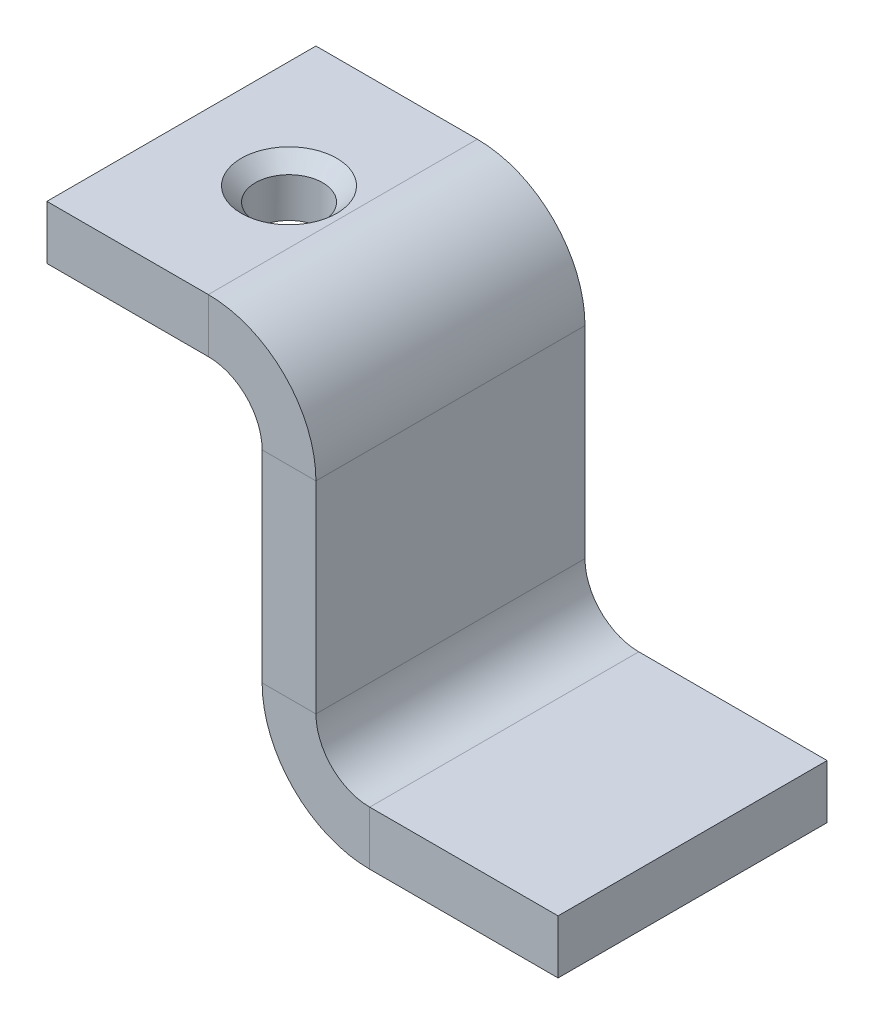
ISO-10303-21;
HEADER;
FILE_DESCRIPTION(('STEP AP214'),'2;1');
FILE_NAME('part.step','',(''),(''),'','','');
FILE_SCHEMA(('AUTOMOTIVE_DESIGN { 1 0 10303 214 1 1 1 1 }'));
ENDSEC;
DATA;
#1=APPLICATION_CONTEXT('core data for automotive mechanical design processes');
#2=APPLICATION_PROTOCOL_DEFINITION('international standard','automotive_design',2000,#1);
#3=PRODUCT_CONTEXT('',#1,'mechanical');
#4=PRODUCT('Part','Part','',(#3));
#5=PRODUCT_RELATED_PRODUCT_CATEGORY('part','',(#4));
#6=PRODUCT_DEFINITION_FORMATION('','',#4);
#7=PRODUCT_DEFINITION_CONTEXT('part definition',#1,'design');
#8=PRODUCT_DEFINITION('design','',#6,#7);
#9=PRODUCT_DEFINITION_SHAPE('','',#8);
#10=(LENGTH_UNIT() NAMED_UNIT(*) SI_UNIT(.MILLI.,.METRE.));
#11=(NAMED_UNIT(*) PLANE_ANGLE_UNIT() SI_UNIT($,.RADIAN.));
#12=(NAMED_UNIT(*) SI_UNIT($,.STERADIAN.) SOLID_ANGLE_UNIT());
#13=UNCERTAINTY_MEASURE_WITH_UNIT(LENGTH_MEASURE(1.E-05),#10,'distance_accuracy_value','');
#14=(GEOMETRIC_REPRESENTATION_CONTEXT(3) GLOBAL_UNCERTAINTY_ASSIGNED_CONTEXT((#13)) GLOBAL_UNIT_ASSIGNED_CONTEXT((#10,
#11,#12)) REPRESENTATION_CONTEXT('',''));
#15=CARTESIAN_POINT('',(0.,0.,0.));
#16=DIRECTION('',(0.,0.,1.));
#17=DIRECTION('',(1.,0.,0.));
#18=AXIS2_PLACEMENT_3D('',#15,#16,#17);
#19=CARTESIAN_POINT('',(-13.2359777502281,9.5,10.));
#20=DIRECTION('',(0.,0.,1.));
#21=DIRECTION('',(1.,0.,0.));
#22=AXIS2_PLACEMENT_3D('',#19,#20,#21);
#23=PLANE('',#22);
#24=DIRECTION('',(-1.,0.,0.));
#25=VECTOR('',#24,1.);
#26=CARTESIAN_POINT('',(-13.2359777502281,9.5,10.));
#27=LINE('',#26,#25);
#28=CARTESIAN_POINT('',(-13.2359777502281,9.5,10.));
#29=VERTEX_POINT('',#28);
#30=CARTESIAN_POINT('',(-15.2359777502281,9.5,10.));
#31=VERTEX_POINT('',#30);
#32=EDGE_CURVE('E13',#29,#31,#27,.T.);
#33=ORIENTED_EDGE('',*,*,#32,.F.);
#34=CARTESIAN_POINT('',(-17.2359777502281,9.5,10.));
#35=DIRECTION('',(0.,0.,1.));
#36=DIRECTION('',(1.,0.,0.));
#37=AXIS2_PLACEMENT_3D('',#34,#35,#36);
#38=CIRCLE('',#37,4.);
#39=CARTESIAN_POINT('',(-17.2359777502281,13.5,10.));
#40=VERTEX_POINT('',#39);
#41=EDGE_CURVE('E262',#40,#29,#38,.F.);
#42=ORIENTED_EDGE('',*,*,#41,.F.);
#43=DIRECTION('',(0.,1.,0.));
#44=VECTOR('',#43,1.);
#45=CARTESIAN_POINT('',(-17.2359777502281,11.5,10.));
#46=LINE('',#45,#44);
#47=CARTESIAN_POINT('',(-17.2359777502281,11.5,10.));
#48=VERTEX_POINT('',#47);
#49=EDGE_CURVE('E59',#48,#40,#46,.T.);
#50=ORIENTED_EDGE('',*,*,#49,.F.);
#51=CARTESIAN_POINT('',(-17.2359777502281,9.5,10.));
#52=DIRECTION('',(0.,0.,1.));
#53=DIRECTION('',(1.,0.,0.));
#54=AXIS2_PLACEMENT_3D('',#51,#52,#53);
#55=CIRCLE('',#54,2.);
#56=EDGE_CURVE('E160',#48,#31,#55,.F.);
#57=ORIENTED_EDGE('',*,*,#56,.T.);
#58=EDGE_LOOP('',(#33,#42,#50,#57));
#59=FACE_BOUND('',#58,.T.);
#60=ADVANCED_FACE('F50',(#59),#23,.T.);
#61=CARTESIAN_POINT('',(-17.2359777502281,11.5,10.));
#62=DIRECTION('',(0.,0.,1.));
#63=DIRECTION('',(1.,0.,0.));
#64=AXIS2_PLACEMENT_3D('',#61,#62,#63);
#65=PLANE('',#64);
#66=DIRECTION('',(0.,-1.,0.));
#67=VECTOR('',#66,1.);
#68=CARTESIAN_POINT('',(-13.2359777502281,13.5,10.));
#69=LINE('',#68,#67);
#70=CARTESIAN_POINT('',(-13.2359777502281,2.,10.));
#71=VERTEX_POINT('',#70);
#72=EDGE_CURVE('E154',#29,#71,#69,.T.);
#73=ORIENTED_EDGE('',*,*,#72,.F.);
#74=ORIENTED_EDGE('',*,*,#32,.T.);
#75=DIRECTION('',(0.,-1.,0.));
#76=VECTOR('',#75,1.);
#77=CARTESIAN_POINT('',(-15.2359777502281,13.5,10.));
#78=LINE('',#77,#76);
#79=CARTESIAN_POINT('',(-15.2359777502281,2.,10.));
#80=VERTEX_POINT('',#79);
#81=EDGE_CURVE('E151',#31,#80,#78,.T.);
#82=ORIENTED_EDGE('',*,*,#81,.T.);
#83=DIRECTION('',(1.,0.,0.));
#84=VECTOR('',#83,1.);
#85=CARTESIAN_POINT('',(-15.2359777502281,2.,10.));
#86=LINE('',#85,#84);
#87=EDGE_CURVE('E242',#80,#71,#86,.T.);
#88=ORIENTED_EDGE('',*,*,#87,.T.);
#89=EDGE_LOOP('',(#73,#74,#82,#88));
#90=FACE_BOUND('',#89,.T.);
#91=ADVANCED_FACE('F149',(#90),#65,.T.);
#92=CARTESIAN_POINT('',(-17.2359777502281,13.5,0.));
#93=DIRECTION('',(0.,0.,-1.));
#94=DIRECTION('',(-1.,0.,0.));
#95=AXIS2_PLACEMENT_3D('',#92,#93,#94);
#96=PLANE('',#95);
#97=DIRECTION('',(0.,-1.,0.));
#98=VECTOR('',#97,1.);
#99=CARTESIAN_POINT('',(-17.2359777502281,13.5,0.));
#100=LINE('',#99,#98);
#101=CARTESIAN_POINT('',(-17.2359777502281,13.5,0.));
#102=VERTEX_POINT('',#101);
#103=CARTESIAN_POINT('',(-17.2359777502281,11.5,0.));
#104=VERTEX_POINT('',#103);
#105=EDGE_CURVE('E247',#102,#104,#100,.T.);
#106=ORIENTED_EDGE('',*,*,#105,.F.);
#107=CARTESIAN_POINT('',(-17.2359777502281,9.5,0.));
#108=DIRECTION('',(0.,0.,1.));
#109=DIRECTION('',(1.,0.,0.));
#110=AXIS2_PLACEMENT_3D('',#107,#108,#109);
#111=CIRCLE('',#110,4.);
#112=CARTESIAN_POINT('',(-13.2359777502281,9.5,0.));
#113=VERTEX_POINT('',#112);
#114=EDGE_CURVE('E199',#102,#113,#111,.F.);
#115=ORIENTED_EDGE('',*,*,#114,.T.);
#116=DIRECTION('',(1.,0.,0.));
#117=VECTOR('',#116,1.);
#118=CARTESIAN_POINT('',(-15.2359777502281,9.5,0.));
#119=LINE('',#118,#117);
#120=CARTESIAN_POINT('',(-15.2359777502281,9.5,0.));
#121=VERTEX_POINT('',#120);
#122=EDGE_CURVE('E245',#121,#113,#119,.T.);
#123=ORIENTED_EDGE('',*,*,#122,.F.);
#124=CARTESIAN_POINT('',(-17.2359777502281,9.5,0.));
#125=DIRECTION('',(0.,0.,1.));
#126=DIRECTION('',(1.,0.,0.));
#127=AXIS2_PLACEMENT_3D('',#124,#125,#126);
#128=CIRCLE('',#127,2.);
#129=EDGE_CURVE('E172',#104,#121,#128,.F.);
#130=ORIENTED_EDGE('',*,*,#129,.F.);
#131=EDGE_LOOP('',(#106,#115,#123,#130));
#132=FACE_BOUND('',#131,.T.);
#133=ADVANCED_FACE('F307',(#132),#96,.T.);
#134=CARTESIAN_POINT('',(-15.2359777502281,9.5,0.));
#135=DIRECTION('',(0.,0.,-1.));
#136=DIRECTION('',(-1.,0.,0.));
#137=AXIS2_PLACEMENT_3D('',#134,#135,#136);
#138=PLANE('',#137);
#139=DIRECTION('',(1.,0.,0.));
#140=VECTOR('',#139,1.);
#141=CARTESIAN_POINT('',(-23.2359777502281,13.5,0.));
#142=LINE('',#141,#140);
#143=CARTESIAN_POINT('',(-23.2359777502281,13.5,0.));
#144=VERTEX_POINT('',#143);
#145=EDGE_CURVE('E202',#144,#102,#142,.T.);
#146=ORIENTED_EDGE('',*,*,#145,.T.);
#147=ORIENTED_EDGE('',*,*,#105,.T.);
#148=DIRECTION('',(1.,0.,0.));
#149=VECTOR('',#148,1.);
#150=CARTESIAN_POINT('',(-23.2359777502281,11.5,0.));
#151=LINE('',#150,#149);
#152=CARTESIAN_POINT('',(-23.2359777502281,11.5,0.));
#153=VERTEX_POINT('',#152);
#154=EDGE_CURVE('E208',#153,#104,#151,.T.);
#155=ORIENTED_EDGE('',*,*,#154,.F.);
#156=DIRECTION('',(0.,1.,0.));
#157=VECTOR('',#156,1.);
#158=CARTESIAN_POINT('',(-23.2359777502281,11.5,0.));
#159=LINE('',#158,#157);
#160=EDGE_CURVE('E205',#153,#144,#159,.T.);
#161=ORIENTED_EDGE('',*,*,#160,.T.);
#162=EDGE_LOOP('',(#146,#147,#155,#161));
#163=FACE_BOUND('',#162,.T.);
#164=ADVANCED_FACE('F311',(#163),#138,.T.);
#165=CARTESIAN_POINT('',(-11.2359777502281,0.,10.));
#166=DIRECTION('',(0.,0.,1.));
#167=DIRECTION('',(1.,0.,0.));
#168=AXIS2_PLACEMENT_3D('',#165,#166,#167);
#169=PLANE('',#168);
#170=DIRECTION('',(0.,-1.,0.));
#171=VECTOR('',#170,1.);
#172=CARTESIAN_POINT('',(-11.2359777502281,0.,10.));
#173=LINE('',#172,#171);
#174=CARTESIAN_POINT('',(-11.2359777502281,0.,10.));
#175=VERTEX_POINT('',#174);
#176=CARTESIAN_POINT('',(-11.2359777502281,-2.,10.));
#177=VERTEX_POINT('',#176);
#178=EDGE_CURVE('E67',#175,#177,#173,.T.);
#179=ORIENTED_EDGE('',*,*,#178,.F.);
#180=CARTESIAN_POINT('',(-11.2359777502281,2.,10.));
#181=DIRECTION('',(0.,0.,-1.));
#182=DIRECTION('',(-1.,0.,0.));
#183=AXIS2_PLACEMENT_3D('',#180,#181,#182);
#184=CIRCLE('',#183,2.);
#185=EDGE_CURVE('E272',#71,#175,#184,.F.);
#186=ORIENTED_EDGE('',*,*,#185,.F.);
#187=ORIENTED_EDGE('',*,*,#87,.F.);
#188=CARTESIAN_POINT('',(-11.2359777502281,2.,10.));
#189=DIRECTION('',(0.,0.,1.));
#190=DIRECTION('',(1.,0.,0.));
#191=AXIS2_PLACEMENT_3D('',#188,#189,#190);
#192=CIRCLE('',#191,4.);
#193=EDGE_CURVE('E180',#80,#177,#192,.T.);
#194=ORIENTED_EDGE('',*,*,#193,.T.);
#195=EDGE_LOOP('',(#179,#186,#187,#194));
#196=FACE_BOUND('',#195,.T.);
#197=ADVANCED_FACE('F317',(#196),#169,.T.);
#198=CARTESIAN_POINT('',(-15.2359777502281,2.,10.));
#199=DIRECTION('',(0.,0.,1.));
#200=DIRECTION('',(1.,0.,0.));
#201=AXIS2_PLACEMENT_3D('',#198,#199,#200);
#202=PLANE('',#201);
#203=DIRECTION('',(1.,0.,0.));
#204=VECTOR('',#203,1.);
#205=CARTESIAN_POINT('',(-13.2359777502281,0.,10.));
#206=LINE('',#205,#204);
#207=CARTESIAN_POINT('',(-4.23597775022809,0.,10.));
#208=VERTEX_POINT('',#207);
#209=EDGE_CURVE('E275',#175,#208,#206,.T.);
#210=ORIENTED_EDGE('',*,*,#209,.F.);
#211=ORIENTED_EDGE('',*,*,#178,.T.);
#212=DIRECTION('',(1.,0.,0.));
#213=VECTOR('',#212,1.);
#214=CARTESIAN_POINT('',(-13.2359777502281,-2.,10.));
#215=LINE('',#214,#213);
#216=CARTESIAN_POINT('',(-4.23597775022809,-2.,10.));
#217=VERTEX_POINT('',#216);
#218=EDGE_CURVE('E121',#177,#217,#215,.T.);
#219=ORIENTED_EDGE('',*,*,#218,.T.);
#220=DIRECTION('',(0.,-1.,0.));
#221=VECTOR('',#220,1.);
#222=CARTESIAN_POINT('',(-4.23597775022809,0.,10.));
#223=LINE('',#222,#221);
#224=EDGE_CURVE('E278',#208,#217,#223,.T.);
#225=ORIENTED_EDGE('',*,*,#224,.F.);
#226=EDGE_LOOP('',(#210,#211,#219,#225));
#227=FACE_BOUND('',#226,.T.);
#228=ADVANCED_FACE('F321',(#227),#202,.T.);
#229=CARTESIAN_POINT('',(-13.2359777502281,2.,0.));
#230=DIRECTION('',(0.,0.,-1.));
#231=DIRECTION('',(-1.,0.,0.));
#232=AXIS2_PLACEMENT_3D('',#229,#230,#231);
#233=PLANE('',#232);
#234=DIRECTION('',(-1.,0.,0.));
#235=VECTOR('',#234,1.);
#236=CARTESIAN_POINT('',(-13.2359777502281,2.,0.));
#237=LINE('',#236,#235);
#238=CARTESIAN_POINT('',(-13.2359777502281,2.,0.));
#239=VERTEX_POINT('',#238);
#240=CARTESIAN_POINT('',(-15.2359777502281,2.,0.));
#241=VERTEX_POINT('',#240);
#242=EDGE_CURVE('E108',#239,#241,#237,.T.);
#243=ORIENTED_EDGE('',*,*,#242,.F.);
#244=CARTESIAN_POINT('',(-11.2359777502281,2.,0.));
#245=DIRECTION('',(0.,0.,-1.));
#246=DIRECTION('',(-1.,0.,0.));
#247=AXIS2_PLACEMENT_3D('',#244,#245,#246);
#248=CIRCLE('',#247,2.);
#249=CARTESIAN_POINT('',(-11.2359777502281,0.,0.));
#250=VERTEX_POINT('',#249);
#251=EDGE_CURVE('E195',#239,#250,#248,.F.);
#252=ORIENTED_EDGE('',*,*,#251,.T.);
#253=DIRECTION('',(0.,1.,0.));
#254=VECTOR('',#253,1.);
#255=CARTESIAN_POINT('',(-11.2359777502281,-2.,0.));
#256=LINE('',#255,#254);
#257=CARTESIAN_POINT('',(-11.2359777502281,-2.,0.));
#258=VERTEX_POINT('',#257);
#259=EDGE_CURVE('E115',#258,#250,#256,.T.);
#260=ORIENTED_EDGE('',*,*,#259,.F.);
#261=CARTESIAN_POINT('',(-11.2359777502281,2.,0.));
#262=DIRECTION('',(0.,0.,1.));
#263=DIRECTION('',(1.,0.,0.));
#264=AXIS2_PLACEMENT_3D('',#261,#262,#263);
#265=CIRCLE('',#264,4.);
#266=EDGE_CURVE('E214',#241,#258,#265,.T.);
#267=ORIENTED_EDGE('',*,*,#266,.F.);
#268=EDGE_LOOP('',(#243,#252,#260,#267));
#269=FACE_BOUND('',#268,.T.);
#270=ADVANCED_FACE('F325',(#269),#233,.T.);
#271=CARTESIAN_POINT('',(-11.2359777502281,-2.,0.));
#272=DIRECTION('',(0.,0.,-1.));
#273=DIRECTION('',(-1.,0.,0.));
#274=AXIS2_PLACEMENT_3D('',#271,#272,#273);
#275=PLANE('',#274);
#276=DIRECTION('',(0.,-1.,0.));
#277=VECTOR('',#276,1.);
#278=CARTESIAN_POINT('',(-13.2359777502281,13.5,0.));
#279=LINE('',#278,#277);
#280=EDGE_CURVE('E197',#113,#239,#279,.T.);
#281=ORIENTED_EDGE('',*,*,#280,.T.);
#282=ORIENTED_EDGE('',*,*,#242,.T.);
#283=DIRECTION('',(0.,-1.,0.));
#284=VECTOR('',#283,1.);
#285=CARTESIAN_POINT('',(-15.2359777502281,13.5,0.));
#286=LINE('',#285,#284);
#287=EDGE_CURVE('E212',#121,#241,#286,.T.);
#288=ORIENTED_EDGE('',*,*,#287,.F.);
#289=ORIENTED_EDGE('',*,*,#122,.T.);
#290=EDGE_LOOP('',(#281,#282,#288,#289));
#291=FACE_BOUND('',#290,.T.);
#292=ADVANCED_FACE('F328',(#291),#275,.T.);
#293=CARTESIAN_POINT('',(-13.2359777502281,-2.,10.));
#294=DIRECTION('',(0.,1.,0.));
#295=DIRECTION('',(0.,0.,1.));
#296=AXIS2_PLACEMENT_3D('',#293,#294,#295);
#297=PLANE('',#296);
#298=DIRECTION('',(1.,0.,0.));
#299=VECTOR('',#298,1.);
#300=CARTESIAN_POINT('',(-13.2359777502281,-2.,0.));
#301=LINE('',#300,#299);
#302=CARTESIAN_POINT('',(-4.23597775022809,-2.,0.));
#303=VERTEX_POINT('',#302);
#304=EDGE_CURVE('E186',#258,#303,#301,.T.);
#305=ORIENTED_EDGE('',*,*,#304,.T.);
#306=DIRECTION('',(0.,0.,-1.));
#307=VECTOR('',#306,1.);
#308=CARTESIAN_POINT('',(-4.23597775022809,-2.,10.));
#309=LINE('',#308,#307);
#310=EDGE_CURVE('E238',#217,#303,#309,.T.);
#311=ORIENTED_EDGE('',*,*,#310,.F.);
#312=ORIENTED_EDGE('',*,*,#218,.F.);
#313=DIRECTION('',(0.,0.,-1.));
#314=VECTOR('',#313,1.);
#315=CARTESIAN_POINT('',(-11.2359777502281,-2.,10.));
#316=LINE('',#315,#314);
#317=EDGE_CURVE('E182',#177,#258,#316,.T.);
#318=ORIENTED_EDGE('',*,*,#317,.T.);
#319=EDGE_LOOP('',(#305,#311,#312,#318));
#320=FACE_BOUND('',#319,.T.);
#321=ADVANCED_FACE('F331',(#320),#297,.F.);
#322=CARTESIAN_POINT('',(-4.23597775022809,0.,10.));
#323=DIRECTION('',(1.,0.,0.));
#324=DIRECTION('',(0.,0.,-1.));
#325=AXIS2_PLACEMENT_3D('',#322,#323,#324);
#326=PLANE('',#325);
#327=DIRECTION('',(0.,-1.,0.));
#328=VECTOR('',#327,1.);
#329=CARTESIAN_POINT('',(-4.23597775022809,0.,0.));
#330=LINE('',#329,#328);
#331=CARTESIAN_POINT('',(-4.23597775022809,0.,0.));
#332=VERTEX_POINT('',#331);
#333=EDGE_CURVE('E189',#332,#303,#330,.T.);
#334=ORIENTED_EDGE('',*,*,#333,.F.);
#335=DIRECTION('',(0.,0.,-1.));
#336=VECTOR('',#335,1.);
#337=CARTESIAN_POINT('',(-4.23597775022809,0.,10.));
#338=LINE('',#337,#336);
#339=EDGE_CURVE('E236',#208,#332,#338,.T.);
#340=ORIENTED_EDGE('',*,*,#339,.F.);
#341=ORIENTED_EDGE('',*,*,#224,.T.);
#342=ORIENTED_EDGE('',*,*,#310,.T.);
#343=EDGE_LOOP('',(#334,#340,#341,#342));
#344=FACE_BOUND('',#343,.T.);
#345=ADVANCED_FACE('F334',(#344),#326,.T.);
#346=CARTESIAN_POINT('',(-13.2359777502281,0.,10.));
#347=DIRECTION('',(0.,1.,0.));
#348=DIRECTION('',(0.,0.,1.));
#349=AXIS2_PLACEMENT_3D('',#346,#347,#348);
#350=PLANE('',#349);
#351=DIRECTION('',(1.,0.,0.));
#352=VECTOR('',#351,1.);
#353=CARTESIAN_POINT('',(-13.2359777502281,0.,0.));
#354=LINE('',#353,#352);
#355=EDGE_CURVE('E192',#250,#332,#354,.T.);
#356=ORIENTED_EDGE('',*,*,#355,.F.);
#357=DIRECTION('',(0.,0.,-1.));
#358=VECTOR('',#357,1.);
#359=CARTESIAN_POINT('',(-11.2359777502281,0.,10.));
#360=LINE('',#359,#358);
#361=EDGE_CURVE('E233',#175,#250,#360,.T.);
#362=ORIENTED_EDGE('',*,*,#361,.F.);
#363=ORIENTED_EDGE('',*,*,#209,.T.);
#364=ORIENTED_EDGE('',*,*,#339,.T.);
#365=EDGE_LOOP('',(#356,#362,#363,#364));
#366=FACE_BOUND('',#365,.T.);
#367=ADVANCED_FACE('F338',(#366),#350,.T.);
#368=CARTESIAN_POINT('',(-11.2359777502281,2.,10.));
#369=DIRECTION('',(0.,0.,-1.));
#370=DIRECTION('',(-1.,0.,0.));
#371=AXIS2_PLACEMENT_3D('',#368,#369,#370);
#372=CYLINDRICAL_SURFACE('',#371,2.);
#373=ORIENTED_EDGE('',*,*,#251,.F.);
#374=DIRECTION('',(0.,0.,-1.));
#375=VECTOR('',#374,1.);
#376=CARTESIAN_POINT('',(-13.2359777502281,2.,10.));
#377=LINE('',#376,#375);
#378=EDGE_CURVE('E230',#71,#239,#377,.T.);
#379=ORIENTED_EDGE('',*,*,#378,.F.);
#380=ORIENTED_EDGE('',*,*,#185,.T.);
#381=ORIENTED_EDGE('',*,*,#361,.T.);
#382=EDGE_LOOP('',(#373,#379,#380,#381));
#383=FACE_BOUND('',#382,.T.);
#384=ADVANCED_FACE('F342',(#383),#372,.F.);
#385=CARTESIAN_POINT('',(-13.2359777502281,13.5,10.));
#386=DIRECTION('',(1.,0.,0.));
#387=DIRECTION('',(0.,1.,0.));
#388=AXIS2_PLACEMENT_3D('',#385,#386,#387);
#389=PLANE('',#388);
#390=ORIENTED_EDGE('',*,*,#280,.F.);
#391=DIRECTION('',(0.,0.,-1.));
#392=VECTOR('',#391,1.);
#393=CARTESIAN_POINT('',(-13.2359777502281,9.5,10.));
#394=LINE('',#393,#392);
#395=EDGE_CURVE('E227',#29,#113,#394,.T.);
#396=ORIENTED_EDGE('',*,*,#395,.F.);
#397=ORIENTED_EDGE('',*,*,#72,.T.);
#398=ORIENTED_EDGE('',*,*,#378,.T.);
#399=EDGE_LOOP('',(#390,#396,#397,#398));
#400=FACE_BOUND('',#399,.T.);
#401=ADVANCED_FACE('F301',(#400),#389,.T.);
#402=CARTESIAN_POINT('',(-17.2359777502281,9.5,10.));
#403=DIRECTION('',(0.,0.,-1.));
#404=DIRECTION('',(-1.,0.,0.));
#405=AXIS2_PLACEMENT_3D('',#402,#403,#404);
#406=CYLINDRICAL_SURFACE('',#405,4.);
#407=ORIENTED_EDGE('',*,*,#114,.F.);
#408=DIRECTION('',(0.,0.,-1.));
#409=VECTOR('',#408,1.);
#410=CARTESIAN_POINT('',(-17.2359777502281,13.5,10.));
#411=LINE('',#410,#409);
#412=EDGE_CURVE('E224',#40,#102,#411,.T.);
#413=ORIENTED_EDGE('',*,*,#412,.F.);
#414=ORIENTED_EDGE('',*,*,#41,.T.);
#415=ORIENTED_EDGE('',*,*,#395,.T.);
#416=EDGE_LOOP('',(#407,#413,#414,#415));
#417=FACE_BOUND('',#416,.T.);
#418=ADVANCED_FACE('F261',(#417),#406,.T.);
#419=CARTESIAN_POINT('',(-23.2359777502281,13.5,10.));
#420=DIRECTION('',(0.,1.,0.));
#421=DIRECTION('',(-1.,0.,0.));
#422=AXIS2_PLACEMENT_3D('',#419,#420,#421);
#423=PLANE('',#422);
#424=CARTESIAN_POINT('',(-19.2359777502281,13.5,5.));
#425=DIRECTION('',(0.,1.,0.));
#426=DIRECTION('',(0.,0.,1.));
#427=AXIS2_PLACEMENT_3D('',#424,#425,#426);
#428=CIRCLE('',#427,1.775);
#429=CARTESIAN_POINT('',(-19.2359777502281,13.5,6.775));
#430=VERTEX_POINT('',#429);
#431=EDGE_CURVE('E285',#430,#430,#428,.T.);
#432=ORIENTED_EDGE('',*,*,#431,.F.);
#433=EDGE_LOOP('',(#432));
#434=FACE_BOUND('',#433,.T.);
#435=ORIENTED_EDGE('',*,*,#145,.F.);
#436=DIRECTION('',(0.,0.,-1.));
#437=VECTOR('',#436,1.);
#438=CARTESIAN_POINT('',(-23.2359777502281,13.5,10.));
#439=LINE('',#438,#437);
#440=CARTESIAN_POINT('',(-23.2359777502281,13.5,10.));
#441=VERTEX_POINT('',#440);
#442=EDGE_CURVE('E222',#441,#144,#439,.T.);
#443=ORIENTED_EDGE('',*,*,#442,.F.);
#444=DIRECTION('',(1.,0.,0.));
#445=VECTOR('',#444,1.);
#446=CARTESIAN_POINT('',(-23.2359777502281,13.5,10.));
#447=LINE('',#446,#445);
#448=EDGE_CURVE('E255',#441,#40,#447,.T.);
#449=ORIENTED_EDGE('',*,*,#448,.T.);
#450=ORIENTED_EDGE('',*,*,#412,.T.);
#451=EDGE_LOOP('',(#435,#443,#449,#450));
#452=FACE_BOUND('',#451,.T.);
#453=ADVANCED_FACE('F266',(#434,#452),#423,.T.);
#454=CARTESIAN_POINT('',(-23.2359777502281,11.5,10.));
#455=DIRECTION('',(-1.,0.,0.));
#456=DIRECTION('',(0.,0.,1.));
#457=AXIS2_PLACEMENT_3D('',#454,#455,#456);
#458=PLANE('',#457);
#459=ORIENTED_EDGE('',*,*,#160,.F.);
#460=DIRECTION('',(0.,0.,-1.));
#461=VECTOR('',#460,1.);
#462=CARTESIAN_POINT('',(-23.2359777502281,11.5,10.));
#463=LINE('',#462,#461);
#464=CARTESIAN_POINT('',(-23.2359777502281,11.5,10.));
#465=VERTEX_POINT('',#464);
#466=EDGE_CURVE('E220',#465,#153,#463,.T.);
#467=ORIENTED_EDGE('',*,*,#466,.F.);
#468=DIRECTION('',(0.,1.,0.));
#469=VECTOR('',#468,1.);
#470=CARTESIAN_POINT('',(-23.2359777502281,11.5,10.));
#471=LINE('',#470,#469);
#472=EDGE_CURVE('E267',#465,#441,#471,.T.);
#473=ORIENTED_EDGE('',*,*,#472,.T.);
#474=ORIENTED_EDGE('',*,*,#442,.T.);
#475=EDGE_LOOP('',(#459,#467,#473,#474));
#476=FACE_BOUND('',#475,.T.);
#477=ADVANCED_FACE('F292',(#476),#458,.T.);
#478=CARTESIAN_POINT('',(-23.2359777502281,11.5,10.));
#479=DIRECTION('',(0.,1.,0.));
#480=DIRECTION('',(-1.,0.,0.));
#481=AXIS2_PLACEMENT_3D('',#478,#479,#480);
#482=PLANE('',#481);
#483=CARTESIAN_POINT('',(-19.2359777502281,11.5,5.));
#484=DIRECTION('',(0.,1.,0.));
#485=DIRECTION('',(-1.,0.,0.));
#486=AXIS2_PLACEMENT_3D('',#483,#484,#485);
#487=CIRCLE('',#486,1.25);
#488=CARTESIAN_POINT('',(-20.4859777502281,11.5,5.));
#489=VERTEX_POINT('',#488);
#490=EDGE_CURVE('E53',#489,#489,#487,.T.);
#491=ORIENTED_EDGE('',*,*,#490,.T.);
#492=EDGE_LOOP('',(#491));
#493=FACE_BOUND('',#492,.T.);
#494=ORIENTED_EDGE('',*,*,#154,.T.);
#495=DIRECTION('',(0.,0.,-1.));
#496=VECTOR('',#495,1.);
#497=CARTESIAN_POINT('',(-17.2359777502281,11.5,10.));
#498=LINE('',#497,#496);
#499=EDGE_CURVE('E174',#48,#104,#498,.T.);
#500=ORIENTED_EDGE('',*,*,#499,.F.);
#501=DIRECTION('',(1.,0.,0.));
#502=VECTOR('',#501,1.);
#503=CARTESIAN_POINT('',(-23.2359777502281,11.5,10.));
#504=LINE('',#503,#502);
#505=EDGE_CURVE('E165',#465,#48,#504,.T.);
#506=ORIENTED_EDGE('',*,*,#505,.F.);
#507=ORIENTED_EDGE('',*,*,#466,.T.);
#508=EDGE_LOOP('',(#494,#500,#506,#507));
#509=FACE_BOUND('',#508,.T.);
#510=ADVANCED_FACE('F298',(#493,#509),#482,.F.);
#511=CARTESIAN_POINT('',(-17.2359777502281,9.5,10.));
#512=DIRECTION('',(0.,0.,-1.));
#513=DIRECTION('',(-1.,0.,0.));
#514=AXIS2_PLACEMENT_3D('',#511,#512,#513);
#515=CYLINDRICAL_SURFACE('',#514,2.);
#516=ORIENTED_EDGE('',*,*,#129,.T.);
#517=DIRECTION('',(0.,0.,-1.));
#518=VECTOR('',#517,1.);
#519=CARTESIAN_POINT('',(-15.2359777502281,9.5,10.));
#520=LINE('',#519,#518);
#521=EDGE_CURVE('E169',#31,#121,#520,.T.);
#522=ORIENTED_EDGE('',*,*,#521,.F.);
#523=ORIENTED_EDGE('',*,*,#56,.F.);
#524=ORIENTED_EDGE('',*,*,#499,.T.);
#525=EDGE_LOOP('',(#516,#522,#523,#524));
#526=FACE_BOUND('',#525,.T.);
#527=ADVANCED_FACE('F170',(#526),#515,.F.);
#528=CARTESIAN_POINT('',(-15.2359777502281,13.5,10.));
#529=DIRECTION('',(1.,0.,0.));
#530=DIRECTION('',(0.,1.,0.));
#531=AXIS2_PLACEMENT_3D('',#528,#529,#530);
#532=PLANE('',#531);
#533=ORIENTED_EDGE('',*,*,#287,.T.);
#534=DIRECTION('',(0.,0.,-1.));
#535=VECTOR('',#534,1.);
#536=CARTESIAN_POINT('',(-15.2359777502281,2.,10.));
#537=LINE('',#536,#535);
#538=EDGE_CURVE('E175',#80,#241,#537,.T.);
#539=ORIENTED_EDGE('',*,*,#538,.F.);
#540=ORIENTED_EDGE('',*,*,#81,.F.);
#541=ORIENTED_EDGE('',*,*,#521,.T.);
#542=EDGE_LOOP('',(#533,#539,#540,#541));
#543=FACE_BOUND('',#542,.T.);
#544=ADVANCED_FACE('F177',(#543),#532,.F.);
#545=CARTESIAN_POINT('',(-11.2359777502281,2.,10.));
#546=DIRECTION('',(0.,0.,-1.));
#547=DIRECTION('',(-1.,0.,0.));
#548=AXIS2_PLACEMENT_3D('',#545,#546,#547);
#549=CYLINDRICAL_SURFACE('',#548,4.);
#550=ORIENTED_EDGE('',*,*,#266,.T.);
#551=ORIENTED_EDGE('',*,*,#317,.F.);
#552=ORIENTED_EDGE('',*,*,#193,.F.);
#553=ORIENTED_EDGE('',*,*,#538,.T.);
#554=EDGE_LOOP('',(#550,#551,#552,#553));
#555=FACE_BOUND('',#554,.T.);
#556=ADVANCED_FACE('F368',(#555),#549,.T.);
#557=CARTESIAN_POINT('',(-11.2359777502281,2.,10.));
#558=DIRECTION('',(0.,0.,-1.));
#559=DIRECTION('',(-1.,0.,0.));
#560=AXIS2_PLACEMENT_3D('',#557,#558,#559);
#561=PLANE('',#560);
#562=ORIENTED_EDGE('',*,*,#505,.T.);
#563=ORIENTED_EDGE('',*,*,#49,.T.);
#564=ORIENTED_EDGE('',*,*,#448,.F.);
#565=ORIENTED_EDGE('',*,*,#472,.F.);
#566=EDGE_LOOP('',(#562,#563,#564,#565));
#567=FACE_BOUND('',#566,.T.);
#568=ADVANCED_FACE('F252',(#567),#561,.F.);
#569=CARTESIAN_POINT('',(-11.2359777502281,2.,0.));
#570=DIRECTION('',(0.,0.,-1.));
#571=DIRECTION('',(-1.,0.,0.));
#572=AXIS2_PLACEMENT_3D('',#569,#570,#571);
#573=PLANE('',#572);
#574=ORIENTED_EDGE('',*,*,#304,.F.);
#575=ORIENTED_EDGE('',*,*,#259,.T.);
#576=ORIENTED_EDGE('',*,*,#355,.T.);
#577=ORIENTED_EDGE('',*,*,#333,.T.);
#578=EDGE_LOOP('',(#574,#575,#576,#577));
#579=FACE_BOUND('',#578,.T.);
#580=ADVANCED_FACE('F372',(#579),#573,.T.);
#581=CARTESIAN_POINT('',(-19.2359777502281,13.5,5.));
#582=DIRECTION('',(0.,1.,0.));
#583=DIRECTION('',(0.,0.,1.));
#584=AXIS2_PLACEMENT_3D('',#581,#582,#583);
#585=CYLINDRICAL_SURFACE('',#584,1.25);
#586=CARTESIAN_POINT('',(-19.2359777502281,12.975,5.));
#587=DIRECTION('',(0.,1.,0.));
#588=DIRECTION('',(0.,0.,1.));
#589=AXIS2_PLACEMENT_3D('',#586,#587,#588);
#590=CIRCLE('',#589,1.25);
#591=CARTESIAN_POINT('',(-19.2359777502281,12.975,6.25));
#592=VERTEX_POINT('',#591);
#593=EDGE_CURVE('E282',#592,#592,#590,.T.);
#594=ORIENTED_EDGE('',*,*,#593,.T.);
#595=EDGE_LOOP('',(#594));
#596=FACE_BOUND('',#595,.T.);
#597=ORIENTED_EDGE('',*,*,#490,.F.);
#598=EDGE_LOOP('',(#597));
#599=FACE_BOUND('',#598,.T.);
#600=ADVANCED_FACE('F375',(#596,#599),#585,.F.);
#601=CARTESIAN_POINT('',(-19.2359777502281,13.5,5.));
#602=DIRECTION('',(0.,1.,0.));
#603=DIRECTION('',(0.,0.,1.));
#604=AXIS2_PLACEMENT_3D('',#601,#602,#603);
#605=CONICAL_SURFACE('',#604,1.775,0.78539816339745);
#606=ORIENTED_EDGE('',*,*,#593,.F.);
#607=EDGE_LOOP('',(#606));
#608=FACE_BOUND('',#607,.T.);
#609=ORIENTED_EDGE('',*,*,#431,.T.);
#610=EDGE_LOOP('',(#609));
#611=FACE_BOUND('',#610,.T.);
#612=ADVANCED_FACE('F289',(#608,#611),#605,.F.);
#613=CLOSED_SHELL('',(#60,#91,#133,#164,#197,#228,#270,#292,#321,#345,#367,#384,#401,#418,#453,
#477,#510,#527,#544,#556,#568,#580,#600,#612));
#614=MANIFOLD_SOLID_BREP('B2',#613);
#615=ADVANCED_BREP_SHAPE_REPRESENTATION('',(#18,#614),#14);
#616=SHAPE_DEFINITION_REPRESENTATION(#9,#615);
ENDSEC;
END-ISO-10303-21;
